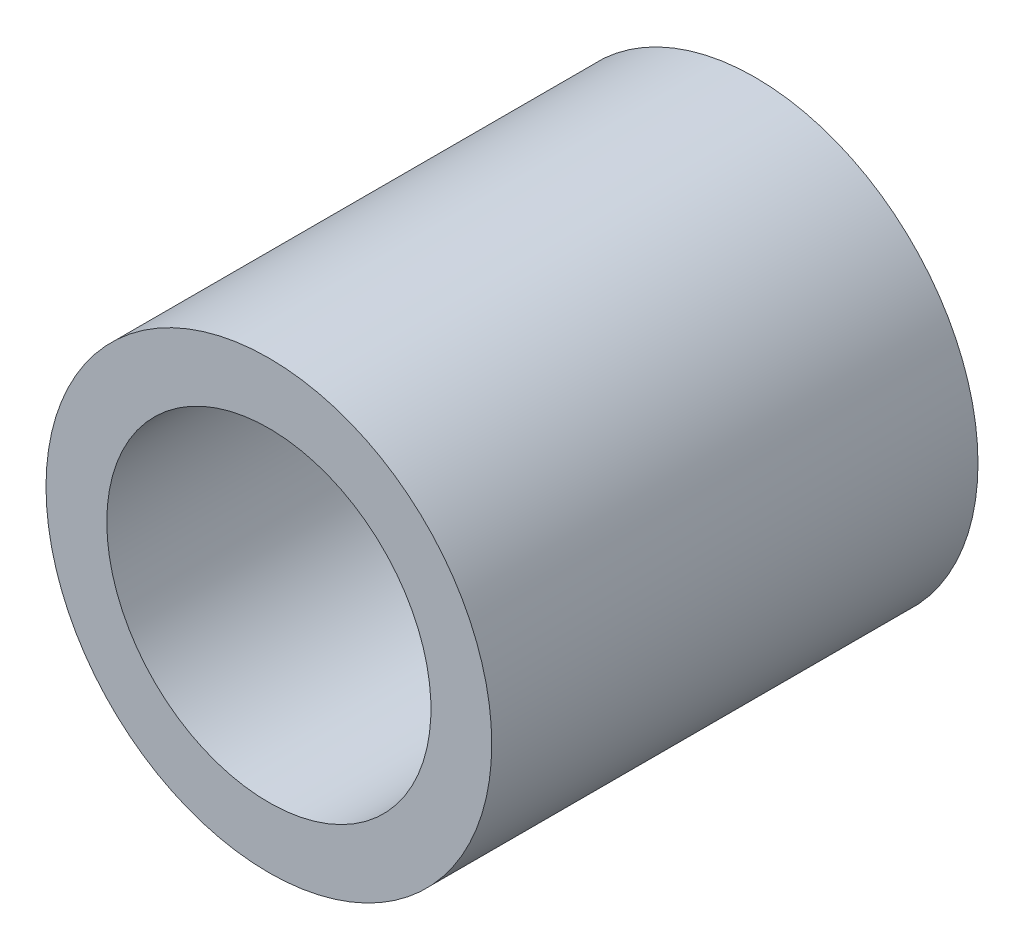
from build123d import *

# Parameters (mm, degrees)
SKETCH1_R      = 8.73125
SKETCH1_R_2    = 6.35
EXTRUDE1_DEPTH = 19.05


with BuildPart() as part:
    # Sketch1 → Extrude1 (new body)
    with BuildSketch(Plane.XY):
        with Locations(Location((0, 0, 0), (0, 0, 180))):
            Circle(SKETCH1_R)
        with Locations(Location((0, 0, 0), (0, 0, 180))):
            Circle(SKETCH1_R_2, mode=Mode.SUBTRACT)
    extrude(amount=EXTRUDE1_DEPTH)


solid = part.part
